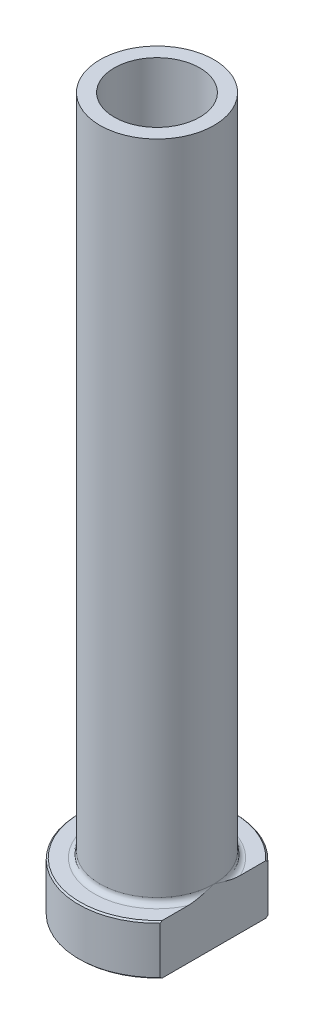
ISO-10303-21;
HEADER;
FILE_DESCRIPTION(('STEP AP214'),'2;1');
FILE_NAME('part.step','',(''),(''),'','','');
FILE_SCHEMA(('AUTOMOTIVE_DESIGN { 1 0 10303 214 1 1 1 1 }'));
ENDSEC;
DATA;
#1=APPLICATION_CONTEXT('core data for automotive mechanical design processes');
#2=APPLICATION_PROTOCOL_DEFINITION('international standard','automotive_design',2000,#1);
#3=PRODUCT_CONTEXT('',#1,'mechanical');
#4=PRODUCT('Part','Part','',(#3));
#5=PRODUCT_RELATED_PRODUCT_CATEGORY('part','',(#4));
#6=PRODUCT_DEFINITION_FORMATION('','',#4);
#7=PRODUCT_DEFINITION_CONTEXT('part definition',#1,'design');
#8=PRODUCT_DEFINITION('design','',#6,#7);
#9=PRODUCT_DEFINITION_SHAPE('','',#8);
#10=(LENGTH_UNIT() NAMED_UNIT(*) SI_UNIT(.MILLI.,.METRE.));
#11=(NAMED_UNIT(*) PLANE_ANGLE_UNIT() SI_UNIT($,.RADIAN.));
#12=(NAMED_UNIT(*) SI_UNIT($,.STERADIAN.) SOLID_ANGLE_UNIT());
#13=UNCERTAINTY_MEASURE_WITH_UNIT(LENGTH_MEASURE(1.E-05),#10,'distance_accuracy_value','');
#14=(GEOMETRIC_REPRESENTATION_CONTEXT(3) GLOBAL_UNCERTAINTY_ASSIGNED_CONTEXT((#13)) GLOBAL_UNIT_ASSIGNED_CONTEXT((#10,
#11,#12)) REPRESENTATION_CONTEXT('',''));
#15=CARTESIAN_POINT('',(0.,0.,0.));
#16=DIRECTION('',(0.,0.,1.));
#17=DIRECTION('',(1.,0.,0.));
#18=AXIS2_PLACEMENT_3D('',#15,#16,#17);
#19=CARTESIAN_POINT('',(0.,92.1876809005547,0.));
#20=DIRECTION('',(0.,1.,0.));
#21=DIRECTION('',(0.,0.,1.));
#22=AXIS2_PLACEMENT_3D('',#19,#20,#21);
#23=CYLINDRICAL_SURFACE('',#22,6.00000000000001);
#24=CARTESIAN_POINT('',(0.,100.,0.));
#25=DIRECTION('',(0.,1.,0.));
#26=DIRECTION('',(0.,0.,1.));
#27=AXIS2_PLACEMENT_3D('',#24,#25,#26);
#28=CIRCLE('',#27,6.00000000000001);
#29=CARTESIAN_POINT('',(0.,100.,6.00000000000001));
#30=VERTEX_POINT('',#29);
#31=EDGE_CURVE('E167',#30,#30,#28,.T.);
#32=ORIENTED_EDGE('',*,*,#31,.T.);
#33=EDGE_LOOP('',(#32));
#34=FACE_BOUND('',#33,.T.);
#35=CARTESIAN_POINT('',(0.,45.,0.));
#36=DIRECTION('',(0.,1.,0.));
#37=DIRECTION('',(0.,0.,1.));
#38=AXIS2_PLACEMENT_3D('',#35,#36,#37);
#39=CIRCLE('',#38,6.00000000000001);
#40=CARTESIAN_POINT('',(0.,45.,6.00000000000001));
#41=VERTEX_POINT('',#40);
#42=EDGE_CURVE('E170',#41,#41,#39,.T.);
#43=ORIENTED_EDGE('',*,*,#42,.F.);
#44=EDGE_LOOP('',(#43));
#45=FACE_BOUND('',#44,.T.);
#46=ADVANCED_FACE('F32',(#34,#45),#23,.F.);
#47=CARTESIAN_POINT('',(-6.00000000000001,100.,0.));
#48=DIRECTION('',(0.,1.,0.));
#49=DIRECTION('',(0.,0.,1.));
#50=AXIS2_PLACEMENT_3D('',#47,#48,#49);
#51=PLANE('',#50);
#52=CARTESIAN_POINT('',(0.,100.,0.));
#53=DIRECTION('',(0.,1.,0.));
#54=DIRECTION('',(0.,0.,1.));
#55=AXIS2_PLACEMENT_3D('',#52,#53,#54);
#56=CIRCLE('',#55,8.);
#57=CARTESIAN_POINT('',(0.,100.,8.));
#58=VERTEX_POINT('',#57);
#59=EDGE_CURVE('E174',#58,#58,#56,.T.);
#60=ORIENTED_EDGE('',*,*,#59,.T.);
#61=EDGE_LOOP('',(#60));
#62=FACE_BOUND('',#61,.T.);
#63=ORIENTED_EDGE('',*,*,#31,.F.);
#64=EDGE_LOOP('',(#63));
#65=FACE_BOUND('',#64,.T.);
#66=ADVANCED_FACE('F157',(#62,#65),#51,.T.);
#67=CARTESIAN_POINT('',(0.,92.1876809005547,0.));
#68=DIRECTION('',(0.,1.,0.));
#69=DIRECTION('',(0.,0.,1.));
#70=AXIS2_PLACEMENT_3D('',#67,#68,#69);
#71=CYLINDRICAL_SURFACE('',#70,7.99999999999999);
#72=CARTESIAN_POINT('',(0.,7.8,0.));
#73=DIRECTION('',(0.,1.,0.));
#74=DIRECTION('',(0.,0.,1.));
#75=AXIS2_PLACEMENT_3D('',#72,#73,#74);
#76=CIRCLE('',#75,7.99999999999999);
#77=CARTESIAN_POINT('',(8.,7.8,0.));
#78=VERTEX_POINT('',#77);
#79=EDGE_CURVE('E180',#78,#78,#76,.T.);
#80=ORIENTED_EDGE('',*,*,#79,.T.);
#81=EDGE_LOOP('',(#80));
#82=FACE_BOUND('',#81,.T.);
#83=ORIENTED_EDGE('',*,*,#59,.F.);
#84=EDGE_LOOP('',(#83));
#85=FACE_BOUND('',#84,.T.);
#86=ADVANCED_FACE('F162',(#82,#85),#71,.T.);
#87=CARTESIAN_POINT('',(-7.99999999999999,7.,0.));
#88=DIRECTION('',(0.,1.,0.));
#89=DIRECTION('',(0.,0.,1.));
#90=AXIS2_PLACEMENT_3D('',#87,#88,#89);
#91=PLANE('',#90);
#92=DIRECTION('',(0.,0.,1.));
#93=VECTOR('',#92,1.);
#94=CARTESIAN_POINT('',(8.,7.,0.));
#95=LINE('',#94,#93);
#96=CARTESIAN_POINT('',(8.,7.,-7.25534285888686));
#97=VERTEX_POINT('',#96);
#98=CARTESIAN_POINT('',(8.,7.,-3.66606055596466));
#99=VERTEX_POINT('',#98);
#100=EDGE_CURVE('E54',#97,#99,#95,.T.);
#101=ORIENTED_EDGE('',*,*,#100,.F.);
#102=CARTESIAN_POINT('',(0.,7.,0.));
#103=DIRECTION('',(0.,1.,0.));
#104=DIRECTION('',(0.,0.,1.));
#105=AXIS2_PLACEMENT_3D('',#102,#103,#104);
#106=CIRCLE('',#105,10.8);
#107=CARTESIAN_POINT('',(8.,7.,7.25534285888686));
#108=VERTEX_POINT('',#107);
#109=EDGE_CURVE('E186',#97,#108,#106,.T.);
#110=ORIENTED_EDGE('',*,*,#109,.T.);
#111=CARTESIAN_POINT('',(8.,7.,3.66606055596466));
#112=VERTEX_POINT('',#111);
#113=EDGE_CURVE('E134',#112,#108,#95,.T.);
#114=ORIENTED_EDGE('',*,*,#113,.F.);
#115=CARTESIAN_POINT('',(0.,7.,0.));
#116=DIRECTION('',(0.,1.,0.));
#117=DIRECTION('',(0.,0.,1.));
#118=AXIS2_PLACEMENT_3D('',#115,#116,#117);
#119=CIRCLE('',#118,8.8);
#120=EDGE_CURVE('E183',#112,#99,#119,.F.);
#121=ORIENTED_EDGE('',*,*,#120,.T.);
#122=EDGE_LOOP('',(#101,#110,#114,#121));
#123=FACE_BOUND('',#122,.T.);
#124=ADVANCED_FACE('F197',(#123),#91,.T.);
#125=CARTESIAN_POINT('',(0.,92.1876809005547,0.));
#126=DIRECTION('',(0.,1.,0.));
#127=DIRECTION('',(0.,0.,1.));
#128=AXIS2_PLACEMENT_3D('',#125,#126,#127);
#129=CYLINDRICAL_SURFACE('',#128,11.);
#130=DIRECTION('',(0.,-1.,0.));
#131=VECTOR('',#130,1.);
#132=CARTESIAN_POINT('',(8.,100.,7.54983443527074));
#133=LINE('',#132,#131);
#134=CARTESIAN_POINT('',(8.,6.80000000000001,7.54983443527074));
#135=VERTEX_POINT('',#134);
#136=CARTESIAN_POINT('',(8.,0.200000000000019,7.54983443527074));
#137=VERTEX_POINT('',#136);
#138=EDGE_CURVE('E82',#135,#137,#133,.T.);
#139=ORIENTED_EDGE('',*,*,#138,.F.);
#140=CARTESIAN_POINT('',(0.,6.80000000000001,0.));
#141=DIRECTION('',(0.,1.,0.));
#142=DIRECTION('',(0.,0.,1.));
#143=AXIS2_PLACEMENT_3D('',#140,#141,#142);
#144=CIRCLE('',#143,11.);
#145=CARTESIAN_POINT('',(8.,6.80000000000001,-7.54983443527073));
#146=VERTEX_POINT('',#145);
#147=EDGE_CURVE('E95',#135,#146,#144,.F.);
#148=ORIENTED_EDGE('',*,*,#147,.T.);
#149=DIRECTION('',(0.,-1.,0.));
#150=VECTOR('',#149,1.);
#151=CARTESIAN_POINT('',(8.,100.,-7.54983443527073));
#152=LINE('',#151,#150);
#153=CARTESIAN_POINT('',(8.,0.20000000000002,-7.54983443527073));
#154=VERTEX_POINT('',#153);
#155=EDGE_CURVE('E192',#146,#154,#152,.T.);
#156=ORIENTED_EDGE('',*,*,#155,.T.);
#157=CARTESIAN_POINT('',(0.,0.20000000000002,0.));
#158=DIRECTION('',(0.,-1.,0.));
#159=DIRECTION('',(0.,0.,-1.));
#160=AXIS2_PLACEMENT_3D('',#157,#158,#159);
#161=CIRCLE('',#160,11.);
#162=EDGE_CURVE('E98',#154,#137,#161,.F.);
#163=ORIENTED_EDGE('',*,*,#162,.T.);
#164=EDGE_LOOP('',(#139,#148,#156,#163));
#165=FACE_BOUND('',#164,.T.);
#166=ADVANCED_FACE('F190',(#165),#129,.T.);
#167=CARTESIAN_POINT('',(-11.,0.,0.));
#168=DIRECTION('',(0.,-1.,0.));
#169=DIRECTION('',(0.,0.,-1.));
#170=AXIS2_PLACEMENT_3D('',#167,#168,#169);
#171=PLANE('',#170);
#172=CARTESIAN_POINT('',(0.,0.,0.));
#173=DIRECTION('',(0.,-1.,0.));
#174=DIRECTION('',(0.,0.,-1.));
#175=AXIS2_PLACEMENT_3D('',#172,#173,#174);
#176=CIRCLE('',#175,6.75000000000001);
#177=CARTESIAN_POINT('',(0.,0.,-6.75000000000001));
#178=VERTEX_POINT('',#177);
#179=EDGE_CURVE('E40',#178,#178,#176,.F.);
#180=ORIENTED_EDGE('',*,*,#179,.T.);
#181=EDGE_LOOP('',(#180));
#182=FACE_BOUND('',#181,.T.);
#183=DIRECTION('',(0.,0.,-1.));
#184=VECTOR('',#183,1.);
#185=CARTESIAN_POINT('',(8.,0.,7.54983443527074));
#186=LINE('',#185,#184);
#187=CARTESIAN_POINT('',(8.,0.,7.25534285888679));
#188=VERTEX_POINT('',#187);
#189=CARTESIAN_POINT('',(8.,0.,-7.25534285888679));
#190=VERTEX_POINT('',#189);
#191=EDGE_CURVE('E47',#188,#190,#186,.T.);
#192=ORIENTED_EDGE('',*,*,#191,.F.);
#193=CARTESIAN_POINT('',(0.,0.,0.));
#194=DIRECTION('',(0.,-1.,0.));
#195=DIRECTION('',(0.,0.,-1.));
#196=AXIS2_PLACEMENT_3D('',#193,#194,#195);
#197=CIRCLE('',#196,10.8);
#198=EDGE_CURVE('E92',#188,#190,#197,.T.);
#199=ORIENTED_EDGE('',*,*,#198,.T.);
#200=EDGE_LOOP('',(#192,#199));
#201=FACE_BOUND('',#200,.T.);
#202=ADVANCED_FACE('F91',(#182,#201),#171,.T.);
#203=CARTESIAN_POINT('',(0.,92.1876809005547,0.));
#204=DIRECTION('',(0.,1.,0.));
#205=DIRECTION('',(0.,0.,1.));
#206=AXIS2_PLACEMENT_3D('',#203,#204,#205);
#207=CYLINDRICAL_SURFACE('',#206,6.24999999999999);
#208=CARTESIAN_POINT('',(0.,0.5,0.));
#209=DIRECTION('',(0.,-1.,0.));
#210=DIRECTION('',(0.,0.,-1.));
#211=AXIS2_PLACEMENT_3D('',#208,#209,#210);
#212=CIRCLE('',#211,6.24999999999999);
#213=CARTESIAN_POINT('',(0.,0.5,-6.24999999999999));
#214=VERTEX_POINT('',#213);
#215=EDGE_CURVE('E11',#214,#214,#212,.T.);
#216=ORIENTED_EDGE('',*,*,#215,.T.);
#217=EDGE_LOOP('',(#216));
#218=FACE_BOUND('',#217,.T.);
#219=CARTESIAN_POINT('',(0.,33.,0.));
#220=DIRECTION('',(0.,1.,0.));
#221=DIRECTION('',(0.,0.,1.));
#222=AXIS2_PLACEMENT_3D('',#219,#220,#221);
#223=CIRCLE('',#222,6.24999999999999);
#224=CARTESIAN_POINT('',(0.,33.,6.24999999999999));
#225=VERTEX_POINT('',#224);
#226=EDGE_CURVE('E172',#225,#225,#223,.T.);
#227=ORIENTED_EDGE('',*,*,#226,.T.);
#228=EDGE_LOOP('',(#227));
#229=FACE_BOUND('',#228,.T.);
#230=ADVANCED_FACE('F215',(#218,#229),#207,.F.);
#231=CARTESIAN_POINT('',(0.,33.,0.));
#232=DIRECTION('',(0.,-1.,0.));
#233=DIRECTION('',(0.,0.,-1.));
#234=AXIS2_PLACEMENT_3D('',#231,#232,#233);
#235=CONICAL_SURFACE('',#234,6.24999999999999,0.0208303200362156);
#236=ORIENTED_EDGE('',*,*,#42,.T.);
#237=EDGE_LOOP('',(#236));
#238=FACE_BOUND('',#237,.T.);
#239=ORIENTED_EDGE('',*,*,#226,.F.);
#240=EDGE_LOOP('',(#239));
#241=FACE_BOUND('',#240,.T.);
#242=ADVANCED_FACE('F111',(#238,#241),#235,.F.);
#243=CARTESIAN_POINT('',(0.,7.8,0.));
#244=DIRECTION('',(0.,1.,0.));
#245=DIRECTION('',(0.,0.,1.));
#246=AXIS2_PLACEMENT_3D('',#243,#244,#245);
#247=TOROIDAL_SURFACE('',#246,8.8,0.8);
#248=ORIENTED_EDGE('',*,*,#120,.F.);
#249=CARTESIAN_POINT('',(8.,7.8,0.));
#250=CARTESIAN_POINT('',(8.,7.8000010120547,-1.09624148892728E-10));
#251=CARTESIAN_POINT('',(8.,7.80000202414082,2.93324026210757E-07));
#252=CARTESIAN_POINT('',(8.,7.80000394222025,1.16283073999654E-06));
#253=CARTESIAN_POINT('',(8.,7.80000483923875,1.75365114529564E-06));
#254=CARTESIAN_POINT('',(8.,7.80000665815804,3.16446746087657E-06));
#255=CARTESIAN_POINT('',(8.,7.80000756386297,4.00549122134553E-06));
#256=CARTESIAN_POINT('',(8.,7.80000923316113,5.7834787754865E-06));
#257=CARTESIAN_POINT('',(8.,7.80000999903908,6.71841986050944E-06));
#258=CARTESIAN_POINT('',(8.,7.80001270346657,1.02037208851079E-05));
#259=CARTESIAN_POINT('',(8.,7.80001449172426,1.28740392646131E-05));
#260=CARTESIAN_POINT('',(8.,7.80001755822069,1.82727375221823E-05));
#261=CARTESIAN_POINT('',(8.,7.80001886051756,2.09881548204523E-05));
#262=CARTESIAN_POINT('',(8.,7.80002405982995,3.20647787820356E-05));
#263=CARTESIAN_POINT('',(8.,7.80002777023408,4.05225563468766E-05));
#264=CARTESIAN_POINT('',(8.,7.80003348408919,5.68037676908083E-05));
#265=CARTESIAN_POINT('',(8.,7.80003564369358,6.45728847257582E-05));
#266=CARTESIAN_POINT('',(8.,7.80005093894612,0.000121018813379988));
#267=CARTESIAN_POINT('',(8.,7.80006211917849,0.000170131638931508));
#268=CARTESIAN_POINT('',(8.,7.80011100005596,0.000362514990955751));
#269=CARTESIAN_POINT('',(8.,7.80015802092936,0.000503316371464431));
#270=CARTESIAN_POINT('',(8.,7.80033939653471,0.00105711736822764));
#271=CARTESIAN_POINT('',(8.,7.8004673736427,0.00147161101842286));
#272=CARTESIAN_POINT('',(8.,7.80097644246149,0.00310648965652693));
#273=CARTESIAN_POINT('',(8.,7.80136531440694,0.00432501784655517));
#274=CARTESIAN_POINT('',(7.99999999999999,7.80297358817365,0.0093795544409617));
#275=CARTESIAN_POINT('',(8.,7.80418342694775,0.0132178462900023));
#276=CARTESIAN_POINT('',(8.00000000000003,7.82754122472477,0.0873020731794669));
#277=CARTESIAN_POINT('',(8.00000000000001,7.84979021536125,0.157524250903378));
#278=CARTESIAN_POINT('',(7.99999999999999,7.89322681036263,0.295235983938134));
#279=CARTESIAN_POINT('',(8.,7.91442151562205,0.362723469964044));
#280=CARTESIAN_POINT('',(8.,7.95923432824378,0.506178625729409));
#281=CARTESIAN_POINT('',(8.,7.98282525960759,0.582154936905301));
#282=CARTESIAN_POINT('',(8.,8.02983069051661,0.735069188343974));
#283=CARTESIAN_POINT('',(8.,8.05324046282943,0.812008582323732));
#284=CARTESIAN_POINT('',(8.,8.09303795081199,0.944645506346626));
#285=CARTESIAN_POINT('',(8.,8.10956807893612,1.00030022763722));
#286=CARTESIAN_POINT('',(8.,8.1422128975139,1.11157683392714));
#287=CARTESIAN_POINT('',(8.,8.15832854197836,1.16719843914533));
#288=CARTESIAN_POINT('',(8.,8.20527739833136,1.33164052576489));
#289=CARTESIAN_POINT('',(8.,8.23549814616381,1.44063711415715));
#290=CARTESIAN_POINT('',(8.,8.29826335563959,1.67606835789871));
#291=CARTESIAN_POINT('',(8.,8.33044741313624,1.80259995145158));
#292=CARTESIAN_POINT('',(8.,8.39126396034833,2.05750030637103));
#293=CARTESIAN_POINT('',(8.,8.41986879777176,2.18587573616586));
#294=CARTESIAN_POINT('',(8.,8.4741420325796,2.45321874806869));
#295=CARTESIAN_POINT('',(8.,8.49943375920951,2.59226394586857));
#296=CARTESIAN_POINT('',(8.,8.54278750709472,2.8715056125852));
#297=CARTESIAN_POINT('',(8.,8.56085024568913,3.01170196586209));
#298=CARTESIAN_POINT('',(8.,8.58291287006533,3.24319459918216));
#299=CARTESIAN_POINT('',(8.,8.589627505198,3.33423069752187));
#300=CARTESIAN_POINT('',(8.,8.59844042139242,3.51651109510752));
#301=CARTESIAN_POINT('',(8.,8.60054027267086,3.60775531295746));
#302=CARTESIAN_POINT('',(8.,8.59923478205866,3.78855451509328));
#303=CARTESIAN_POINT('',(8.,8.59592927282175,3.87810991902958));
#304=CARTESIAN_POINT('',(8.,8.58288784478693,4.05671727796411));
#305=CARTESIAN_POINT('',(8.,8.57315718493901,4.14576958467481));
#306=CARTESIAN_POINT('',(8.,8.54786053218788,4.30910044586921));
#307=CARTESIAN_POINT('',(8.,8.53341905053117,4.38354919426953));
#308=CARTESIAN_POINT('',(8.,8.49747543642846,4.53120906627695));
#309=CARTESIAN_POINT('',(8.,8.47593618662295,4.60441150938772));
#310=CARTESIAN_POINT('',(8.,8.42376924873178,4.74853436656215));
#311=CARTESIAN_POINT('',(8.,8.39303920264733,4.81941853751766));
#312=CARTESIAN_POINT('',(8.,8.32008168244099,4.95490582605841));
#313=CARTESIAN_POINT('',(8.,8.27792970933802,5.01954653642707));
#314=CARTESIAN_POINT('',(8.,8.20692535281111,5.10354772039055));
#315=CARTESIAN_POINT('',(8.,8.18397837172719,5.12788591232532));
#316=CARTESIAN_POINT('',(8.,8.1350351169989,5.17336988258));
#317=CARTESIAN_POINT('',(8.,8.10903727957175,5.19451401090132));
#318=CARTESIAN_POINT('',(8.,8.05362521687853,5.23266411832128));
#319=CARTESIAN_POINT('',(8.,8.02417247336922,5.2496152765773));
#320=CARTESIAN_POINT('',(8.,7.96255238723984,5.27751973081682));
#321=CARTESIAN_POINT('',(8.,7.93039220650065,5.28848831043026));
#322=CARTESIAN_POINT('',(8.,7.87282733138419,5.30129051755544));
#323=CARTESIAN_POINT('',(8.,7.84777777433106,5.304735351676));
#324=CARTESIAN_POINT('',(8.,7.79745799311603,5.3073068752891));
#325=CARTESIAN_POINT('',(8.,7.77218785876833,5.30643524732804));
#326=CARTESIAN_POINT('',(8.,7.72220872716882,5.30045124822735));
#327=CARTESIAN_POINT('',(8.,7.69749884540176,5.2953461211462));
#328=CARTESIAN_POINT('',(8.,7.64919855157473,5.28130622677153));
#329=CARTESIAN_POINT('',(8.,7.62560888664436,5.27236894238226));
#330=CARTESIAN_POINT('',(8.,7.57186978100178,5.24749103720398));
#331=CARTESIAN_POINT('',(8.,7.54235117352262,5.23019143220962));
#332=CARTESIAN_POINT('',(8.,7.48647501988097,5.19107874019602));
#333=CARTESIAN_POINT('',(8.,7.46012476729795,5.16925554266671));
#334=CARTESIAN_POINT('',(8.,7.39758131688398,5.11005232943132));
#335=CARTESIAN_POINT('',(8.,7.36345256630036,5.07050732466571));
#336=CARTESIAN_POINT('',(8.,7.30158414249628,4.98680536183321));
#337=CARTESIAN_POINT('',(8.,7.27385227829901,4.94264286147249));
#338=CARTESIAN_POINT('',(8.,7.22655631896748,4.85651446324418));
#339=CARTESIAN_POINT('',(8.,7.20642608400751,4.81485346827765));
#340=CARTESIAN_POINT('',(8.,7.16979237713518,4.72995016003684));
#341=CARTESIAN_POINT('',(8.,7.15329194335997,4.68670655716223));
#342=CARTESIAN_POINT('',(8.,7.1082475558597,4.55471342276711));
#343=CARTESIAN_POINT('',(8.,7.08448205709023,4.46433285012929));
#344=CARTESIAN_POINT('',(8.,7.04606817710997,4.27884520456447));
#345=CARTESIAN_POINT('',(8.,7.03172934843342,4.18367881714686));
#346=CARTESIAN_POINT('',(8.,7.01115182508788,3.99231790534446));
#347=CARTESIAN_POINT('',(8.,7.00492963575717,3.8961216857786));
#348=CARTESIAN_POINT('',(8.,6.99917472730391,3.70683203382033));
#349=CARTESIAN_POINT('',(8.,6.99942213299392,3.6137441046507));
#350=CARTESIAN_POINT('',(8.,7.00500334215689,3.42814181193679));
#351=CARTESIAN_POINT('',(8.,7.01031504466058,3.33562671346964));
#352=CARTESIAN_POINT('',(8.,7.02729273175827,3.12465235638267));
#353=CARTESIAN_POINT('',(8.,7.04033732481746,3.00630616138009));
#354=CARTESIAN_POINT('',(8.,7.07206018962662,2.7704332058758));
#355=CARTESIAN_POINT('',(8.,7.09073668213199,2.65290619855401));
#356=CARTESIAN_POINT('',(8.,7.13314336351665,2.41598317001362));
#357=CARTESIAN_POINT('',(8.,7.15698005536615,2.29660645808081));
#358=CARTESIAN_POINT('',(8.,7.20856500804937,2.05839418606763));
#359=CARTESIAN_POINT('',(8.,7.23632304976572,1.93956077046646));
#360=CARTESIAN_POINT('',(8.,7.30538420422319,1.66026758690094));
#361=CARTESIAN_POINT('',(8.,7.3479797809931,1.50012949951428));
#362=CARTESIAN_POINT('',(8.,7.43661699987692,1.18271330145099));
#363=CARTESIAN_POINT('',(8.,7.48261587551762,1.02542306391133));
#364=CARTESIAN_POINT('',(8.,7.55073856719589,0.798945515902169));
#365=CARTESIAN_POINT('',(8.,7.57189590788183,0.729464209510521));
#366=CARTESIAN_POINT('',(8.,7.61466169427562,0.590318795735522));
#367=CARTESIAN_POINT('',(8.,7.63627166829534,0.520655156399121));
#368=CARTESIAN_POINT('',(8.,7.68075896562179,0.378072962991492));
#369=CARTESIAN_POINT('',(7.99999999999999,7.70364749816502,0.305157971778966));
#370=CARTESIAN_POINT('',(8.00000000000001,7.74926260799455,0.160522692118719));
#371=CARTESIAN_POINT('',(8.00000000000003,7.77198614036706,0.0888015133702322));
#372=CARTESIAN_POINT('',(8.,7.79581756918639,0.0132146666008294));
#373=CARTESIAN_POINT('',(7.99999999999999,7.79702841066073,0.00937319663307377));
#374=CARTESIAN_POINT('',(8.,7.79863692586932,0.00431792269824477));
#375=CARTESIAN_POINT('',(8.,7.79902501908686,0.00310183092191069));
#376=CARTESIAN_POINT('',(8.,7.79953313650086,0.00147000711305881));
#377=CARTESIAN_POINT('',(8.,7.79966092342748,0.00105612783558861));
#378=CARTESIAN_POINT('',(8.,7.79984206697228,0.000503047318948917));
#379=CARTESIAN_POINT('',(8.,7.79988905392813,0.000362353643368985));
#380=CARTESIAN_POINT('',(8.,7.79993790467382,0.000170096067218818));
#381=CARTESIAN_POINT('',(8.,7.7999490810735,0.000120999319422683));
#382=CARTESIAN_POINT('',(8.,7.79996436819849,6.45695774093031E-05));
#383=CARTESIAN_POINT('',(8.,7.79996652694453,5.68014442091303E-05));
#384=CARTESIAN_POINT('',(8.,7.7999722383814,4.05221672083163E-05));
#385=CARTESIAN_POINT('',(8.,7.79997594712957,3.20652901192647E-05));
#386=CARTESIAN_POINT('',(8.,7.79998114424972,2.09895688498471E-05));
#387=CARTESIAN_POINT('',(8.,7.79998244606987,1.82742250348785E-05));
#388=CARTESIAN_POINT('',(8.,7.79998551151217,1.28755875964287E-05));
#389=CARTESIAN_POINT('',(8.,7.79998729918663,1.02052490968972E-05));
#390=CARTESIAN_POINT('',(8.,7.79999000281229,6.71981807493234E-06));
#391=CARTESIAN_POINT('',(8.,7.79999076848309,5.78481736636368E-06));
#392=CARTESIAN_POINT('',(8.,7.7999924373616,4.00667324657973E-06));
#393=CARTESIAN_POINT('',(8.,7.79999334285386,3.16555171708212E-06));
#394=CARTESIAN_POINT('',(8.,7.79999516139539,1.75450195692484E-06));
#395=CARTESIAN_POINT('',(8.,7.79999605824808,1.163552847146E-06));
#396=CARTESIAN_POINT('',(8.,7.79999797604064,2.93728112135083E-07));
#397=CARTESIAN_POINT('',(8.,7.79999898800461,1.09621400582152E-10));
#398=CARTESIAN_POINT('',(8.,7.8,0.));
#399=B_SPLINE_CURVE_WITH_KNOTS('',3,(#249,#250,#251,#252,#253,#254,#255,#256,#257,#258,#259,
#260,#261,#262,#263,#264,#265,#266,#267,#268,#269,#270,#271,#272,#273,#274,#275,#276,#277,#278,
#279,#280,#281,#282,#283,#284,#285,#286,#287,#288,#289,#290,#291,#292,#293,#294,#295,#296,#297,
#298,#299,#300,#301,#302,#303,#304,#305,#306,#307,#308,#309,#310,#311,#312,#313,#314,#315,#316,
#317,#318,#319,#320,#321,#322,#323,#324,#325,#326,#327,#328,#329,#330,#331,#332,#333,#334,#335,
#336,#337,#338,#339,#340,#341,#342,#343,#344,#345,#346,#347,#348,#349,#350,#351,#352,#353,#354,
#355,#356,#357,#358,#359,#360,#361,#362,#363,#364,#365,#366,#367,#368,#369,#370,#371,#372,#373,
#374,#375,#376,#377,#378,#379,#380,#381,#382,#383,#384,#385,#386,#387,#388,#389,#390,#391,#392,
#393,#394,#395,#396,#397,#398),.UNSPECIFIED.,.T.,.F.,(4,2,2,2,2,2,2,2,2,2,2,2,2,2,2,2,2,2,2,2,2,
2,2,2,2,2,2,2,2,2,2,2,2,2,2,2,2,2,2,2,2,2,2,2,2,2,2,2,2,2,2,2,2,2,2,2,2,2,2,2,2,2,2,2,2,2,2,2,2,
2,2,2,2,2,4),(0.,3.04287706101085E-06,6.25420437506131E-06,9.9438686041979E-06,
1.35664386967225E-05,2.31665096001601E-05,3.21939900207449E-05,5.98353481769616E-05,
8.39944790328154E-05,0.000235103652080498,0.000679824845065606,0.00198183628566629,
0.00581831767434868,0.0178924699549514,0.238870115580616,0.451084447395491,0.689746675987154,
0.931010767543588,1.10518257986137,1.27890913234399,1.61821807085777,2.00985537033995,
2.40435266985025,2.82819297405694,3.25199120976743,3.52574836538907,3.79941235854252,
4.06807884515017,4.33652570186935,4.5637808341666,4.79224376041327,5.02335234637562,
5.25296903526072,5.35309534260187,5.45327319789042,5.55469877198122,5.65586400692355,
5.73137360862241,5.80685377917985,5.88220505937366,5.95760590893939,6.05967508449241,
6.16197489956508,6.31780492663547,6.47382418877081,6.61243130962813,6.7511540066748,
7.03070266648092,7.31902502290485,7.60793277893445,7.88703491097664,8.1649245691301,
8.52193605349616,8.87883486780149,9.24395493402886,9.61000233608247,10.1070420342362,
10.5986476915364,10.8165407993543,11.035354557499,11.264626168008,11.4903206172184,
11.5024047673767,11.5062335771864,11.5075336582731,11.5079780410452,11.5081291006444,
11.5081532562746,11.5081808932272,11.5081899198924,11.5081995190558,11.5082031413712,
11.5082068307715,11.5082100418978,11.5082130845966),.UNSPECIFIED.);
#400=EDGE_CURVE('E126',#112,#78,#399,.T.);
#401=ORIENTED_EDGE('',*,*,#400,.T.);
#402=ORIENTED_EDGE('',*,*,#79,.F.);
#403=CARTESIAN_POINT('',(8.,7.8,0.));
#404=CARTESIAN_POINT('',(8.,7.7999989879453,1.09627971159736E-10));
#405=CARTESIAN_POINT('',(8.,7.79999797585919,-2.93324022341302E-07));
#406=CARTESIAN_POINT('',(8.,7.79999605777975,-1.16283073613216E-06));
#407=CARTESIAN_POINT('',(8.,7.79999516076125,-1.75365114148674E-06));
#408=CARTESIAN_POINT('',(8.,7.79999334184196,-3.16446745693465E-06));
#409=CARTESIAN_POINT('',(8.,7.79999243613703,-4.00549121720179E-06));
#410=CARTESIAN_POINT('',(8.,7.79999076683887,-5.78347877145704E-06));
#411=CARTESIAN_POINT('',(8.,7.79999000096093,-6.71841985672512E-06));
#412=CARTESIAN_POINT('',(8.,7.79998729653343,-1.02037208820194E-05));
#413=CARTESIAN_POINT('',(8.,7.79998550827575,-1.28740392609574E-05));
#414=CARTESIAN_POINT('',(8.,7.79998244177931,-1.82727375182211E-05));
#415=CARTESIAN_POINT('',(8.,7.79998113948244,-2.09881548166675E-05));
#416=CARTESIAN_POINT('',(8.,7.79997594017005,-3.20647787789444E-05));
#417=CARTESIAN_POINT('',(8.,7.79997222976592,-4.05225563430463E-05));
#418=CARTESIAN_POINT('',(8.,7.79996651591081,-5.68037676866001E-05));
#419=CARTESIAN_POINT('',(8.,7.79996435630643,-6.4572884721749E-05));
#420=CARTESIAN_POINT('',(8.,7.79994906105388,-0.000121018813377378));
#421=CARTESIAN_POINT('',(8.,7.79993788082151,-0.000170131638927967));
#422=CARTESIAN_POINT('',(8.,7.79988899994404,-0.000362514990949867));
#423=CARTESIAN_POINT('',(8.,7.79984197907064,-0.000503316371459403));
#424=CARTESIAN_POINT('',(8.,7.79966060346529,-0.00105711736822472));
#425=CARTESIAN_POINT('',(8.,7.7995326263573,-0.00147161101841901));
#426=CARTESIAN_POINT('',(8.,7.7990235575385,-0.00310648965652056));
#427=CARTESIAN_POINT('',(8.,7.79863468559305,-0.00432501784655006));
#428=CARTESIAN_POINT('',(7.99999999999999,7.79702641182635,-0.00937955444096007));
#429=CARTESIAN_POINT('',(8.,7.79581657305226,-0.0132178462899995));
#430=CARTESIAN_POINT('',(8.00000000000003,7.77245877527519,-0.087302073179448));
#431=CARTESIAN_POINT('',(8.00000000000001,7.75020978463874,-0.157524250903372));
#432=CARTESIAN_POINT('',(7.99999999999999,7.70677318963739,-0.295235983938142));
#433=CARTESIAN_POINT('',(8.,7.68557848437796,-0.362723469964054));
#434=CARTESIAN_POINT('',(8.,7.64076567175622,-0.506178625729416));
#435=CARTESIAN_POINT('',(8.,7.61717474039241,-0.582154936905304));
#436=CARTESIAN_POINT('',(8.,7.57016930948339,-0.735069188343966));
#437=CARTESIAN_POINT('',(8.,7.54675953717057,-0.812008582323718));
#438=CARTESIAN_POINT('',(8.,7.50696204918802,-0.944645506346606));
#439=CARTESIAN_POINT('',(8.,7.49043192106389,-1.0003002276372));
#440=CARTESIAN_POINT('',(8.,7.4577871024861,-1.11157683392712));
#441=CARTESIAN_POINT('',(8.,7.44167145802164,-1.16719843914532));
#442=CARTESIAN_POINT('',(8.,7.39472260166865,-1.33164052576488));
#443=CARTESIAN_POINT('',(8.,7.3645018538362,-1.44063711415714));
#444=CARTESIAN_POINT('',(8.,7.30173664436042,-1.67606835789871));
#445=CARTESIAN_POINT('',(8.,7.26955258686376,-1.80259995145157));
#446=CARTESIAN_POINT('',(8.,7.20873603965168,-2.05750030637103));
#447=CARTESIAN_POINT('',(8.,7.18013120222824,-2.18587573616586));
#448=CARTESIAN_POINT('',(8.,7.1258579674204,-2.45321874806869));
#449=CARTESIAN_POINT('',(8.,7.10056624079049,-2.59226394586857));
#450=CARTESIAN_POINT('',(8.,7.05721249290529,-2.8715056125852));
#451=CARTESIAN_POINT('',(8.,7.03914975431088,-3.01170196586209));
#452=CARTESIAN_POINT('',(8.,7.01708712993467,-3.24319459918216));
#453=CARTESIAN_POINT('',(8.,7.010372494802,-3.33423069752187));
#454=CARTESIAN_POINT('',(8.,7.00155957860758,-3.51651109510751));
#455=CARTESIAN_POINT('',(8.,6.99945972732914,-3.60775531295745));
#456=CARTESIAN_POINT('',(8.,7.00076521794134,-3.78855451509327));
#457=CARTESIAN_POINT('',(8.,7.00407072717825,-3.87810991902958));
#458=CARTESIAN_POINT('',(8.,7.01711215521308,-4.05671727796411));
#459=CARTESIAN_POINT('',(8.,7.02684281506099,-4.14576958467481));
#460=CARTESIAN_POINT('',(8.,7.05213946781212,-4.30910044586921));
#461=CARTESIAN_POINT('',(8.,7.06658094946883,-4.38354919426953));
#462=CARTESIAN_POINT('',(8.,7.10252456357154,-4.53120906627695));
#463=CARTESIAN_POINT('',(8.,7.12406381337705,-4.60441150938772));
#464=CARTESIAN_POINT('',(8.,7.17623075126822,-4.74853436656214));
#465=CARTESIAN_POINT('',(8.,7.20696079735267,-4.81941853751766));
#466=CARTESIAN_POINT('',(8.,7.27991831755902,-4.95490582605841));
#467=CARTESIAN_POINT('',(8.,7.32207029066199,-5.01954653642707));
#468=CARTESIAN_POINT('',(8.,7.39307464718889,-5.10354772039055));
#469=CARTESIAN_POINT('',(8.,7.41602162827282,-5.12788591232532));
#470=CARTESIAN_POINT('',(8.,7.4649648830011,-5.17336988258));
#471=CARTESIAN_POINT('',(8.,7.49096272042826,-5.19451401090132));
#472=CARTESIAN_POINT('',(8.,7.54637478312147,-5.23266411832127));
#473=CARTESIAN_POINT('',(8.,7.57582752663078,-5.24961527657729));
#474=CARTESIAN_POINT('',(8.,7.63744761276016,-5.27751973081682));
#475=CARTESIAN_POINT('',(8.,7.66960779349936,-5.28848831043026));
#476=CARTESIAN_POINT('',(8.,7.72717266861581,-5.30129051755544));
#477=CARTESIAN_POINT('',(8.,7.75222222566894,-5.304735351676));
#478=CARTESIAN_POINT('',(8.,7.80254200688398,-5.3073068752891));
#479=CARTESIAN_POINT('',(8.,7.82781214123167,-5.30643524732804));
#480=CARTESIAN_POINT('',(8.,7.87779127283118,-5.30045124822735));
#481=CARTESIAN_POINT('',(8.,7.90250115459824,-5.2953461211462));
#482=CARTESIAN_POINT('',(8.,7.95080144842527,-5.28130622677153));
#483=CARTESIAN_POINT('',(8.,7.97439111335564,-5.27236894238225));
#484=CARTESIAN_POINT('',(8.,8.02813021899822,-5.24749103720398));
#485=CARTESIAN_POINT('',(8.,8.05764882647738,-5.23019143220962));
#486=CARTESIAN_POINT('',(8.,8.11352498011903,-5.19107874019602));
#487=CARTESIAN_POINT('',(8.,8.13987523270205,-5.16925554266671));
#488=CARTESIAN_POINT('',(8.,8.20241868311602,-5.11005232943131));
#489=CARTESIAN_POINT('',(8.,8.23654743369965,-5.0705073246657));
#490=CARTESIAN_POINT('',(8.,8.29841585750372,-4.9868053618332));
#491=CARTESIAN_POINT('',(8.,8.326147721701,-4.94264286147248));
#492=CARTESIAN_POINT('',(8.,8.37344368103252,-4.85651446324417));
#493=CARTESIAN_POINT('',(8.,8.39357391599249,-4.81485346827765));
#494=CARTESIAN_POINT('',(8.,8.43020762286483,-4.72995016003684));
#495=CARTESIAN_POINT('',(8.,8.44670805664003,-4.68670655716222));
#496=CARTESIAN_POINT('',(8.,8.4917524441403,-4.5547134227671));
#497=CARTESIAN_POINT('',(8.,8.51551794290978,-4.46433285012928));
#498=CARTESIAN_POINT('',(8.,8.55393182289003,-4.27884520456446));
#499=CARTESIAN_POINT('',(8.,8.56827065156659,-4.18367881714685));
#500=CARTESIAN_POINT('',(8.,8.58884817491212,-3.99231790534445));
#501=CARTESIAN_POINT('',(8.,8.59507036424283,-3.89612168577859));
#502=CARTESIAN_POINT('',(8.,8.60082527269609,-3.70683203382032));
#503=CARTESIAN_POINT('',(8.,8.60057786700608,-3.61374410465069));
#504=CARTESIAN_POINT('',(8.,8.59499665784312,-3.42814181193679));
#505=CARTESIAN_POINT('',(8.,8.58968495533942,-3.33562671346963));
#506=CARTESIAN_POINT('',(8.,8.57270726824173,-3.12465235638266));
#507=CARTESIAN_POINT('',(8.,8.55966267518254,-3.00630616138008));
#508=CARTESIAN_POINT('',(8.,8.52793981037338,-2.77043320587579));
#509=CARTESIAN_POINT('',(8.,8.50926331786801,-2.65290619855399));
#510=CARTESIAN_POINT('',(8.,8.46685663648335,-2.41598317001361));
#511=CARTESIAN_POINT('',(8.,8.44301994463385,-2.2966064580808));
#512=CARTESIAN_POINT('',(8.,8.39143499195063,-2.05839418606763));
#513=CARTESIAN_POINT('',(8.,8.36367695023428,-1.93956077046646));
#514=CARTESIAN_POINT('',(8.,8.29461579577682,-1.66026758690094));
#515=CARTESIAN_POINT('',(8.,8.2520202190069,-1.5001294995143));
#516=CARTESIAN_POINT('',(8.,8.16338300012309,-1.18271330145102));
#517=CARTESIAN_POINT('',(8.,8.1173841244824,-1.02542306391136));
#518=CARTESIAN_POINT('',(8.,8.04926143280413,-0.798945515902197));
#519=CARTESIAN_POINT('',(8.,8.02810409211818,-0.729464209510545));
#520=CARTESIAN_POINT('',(8.,7.98533830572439,-0.590318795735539));
#521=CARTESIAN_POINT('',(8.,7.96372833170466,-0.520655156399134));
#522=CARTESIAN_POINT('',(8.,7.91924103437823,-0.378072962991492));
#523=CARTESIAN_POINT('',(7.99999999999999,7.89635250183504,-0.305157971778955));
#524=CARTESIAN_POINT('',(8.00000000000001,7.8507373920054,-0.160522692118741));
#525=CARTESIAN_POINT('',(8.00000000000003,7.82801385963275,-0.0888015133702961));
#526=CARTESIAN_POINT('',(8.,7.80418243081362,-0.0132146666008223));
#527=CARTESIAN_POINT('',(7.99999999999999,7.8029715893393,-0.00937319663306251));
#528=CARTESIAN_POINT('',(8.,7.80136307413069,-0.0043179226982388));
#529=CARTESIAN_POINT('',(8.,7.80097498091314,-0.00310183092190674));
#530=CARTESIAN_POINT('',(8.,7.80046686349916,-0.00147000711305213));
#531=CARTESIAN_POINT('',(8.,7.80033907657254,-0.00105612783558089));
#532=CARTESIAN_POINT('',(8.,7.80015793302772,-0.000503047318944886));
#533=CARTESIAN_POINT('',(8.,7.80011094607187,-0.000362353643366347));
#534=CARTESIAN_POINT('',(8.,7.80006209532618,-0.000170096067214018));
#535=CARTESIAN_POINT('',(8.,7.80005091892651,-0.000120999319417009));
#536=CARTESIAN_POINT('',(8.,7.80003563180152,-6.45695774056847E-05));
#537=CARTESIAN_POINT('',(8.,7.80003347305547,-5.68014442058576E-05));
#538=CARTESIAN_POINT('',(8.,7.8000277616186,-4.05221672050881E-05));
#539=CARTESIAN_POINT('',(8.,7.80002405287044,-3.20652901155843E-05));
#540=CARTESIAN_POINT('',(8.,7.80001885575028,-2.0989568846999E-05));
#541=CARTESIAN_POINT('',(8.,7.80001755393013,-1.8274225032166E-05));
#542=CARTESIAN_POINT('',(8.,7.80001448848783,-1.28755875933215E-05));
#543=CARTESIAN_POINT('',(8.,7.80001270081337,-1.02052490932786E-05));
#544=CARTESIAN_POINT('',(8.,7.80000999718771,-6.71981807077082E-06));
#545=CARTESIAN_POINT('',(8.,7.80000923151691,-5.78481736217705E-06));
#546=CARTESIAN_POINT('',(8.,7.8000075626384,-4.00667324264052E-06));
#547=CARTESIAN_POINT('',(8.,7.80000665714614,-3.1655517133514E-06));
#548=CARTESIAN_POINT('',(8.,7.80000483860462,-1.75450195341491E-06));
#549=CARTESIAN_POINT('',(8.,7.80000394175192,-1.16355284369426E-06));
#550=CARTESIAN_POINT('',(8.,7.80000202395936,-2.93728108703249E-07));
#551=CARTESIAN_POINT('',(8.,7.80000101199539,-1.09617870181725E-10));
#552=CARTESIAN_POINT('',(8.,7.8,0.));
#553=B_SPLINE_CURVE_WITH_KNOTS('',3,(#403,#404,#405,#406,#407,#408,#409,#410,#411,#412,#413,
#414,#415,#416,#417,#418,#419,#420,#421,#422,#423,#424,#425,#426,#427,#428,#429,#430,#431,#432,
#433,#434,#435,#436,#437,#438,#439,#440,#441,#442,#443,#444,#445,#446,#447,#448,#449,#450,#451,
#452,#453,#454,#455,#456,#457,#458,#459,#460,#461,#462,#463,#464,#465,#466,#467,#468,#469,#470,
#471,#472,#473,#474,#475,#476,#477,#478,#479,#480,#481,#482,#483,#484,#485,#486,#487,#488,#489,
#490,#491,#492,#493,#494,#495,#496,#497,#498,#499,#500,#501,#502,#503,#504,#505,#506,#507,#508,
#509,#510,#511,#512,#513,#514,#515,#516,#517,#518,#519,#520,#521,#522,#523,#524,#525,#526,#527,
#528,#529,#530,#531,#532,#533,#534,#535,#536,#537,#538,#539,#540,#541,#542,#543,#544,#545,#546,
#547,#548,#549,#550,#551,#552),.UNSPECIFIED.,.T.,.F.,(4,2,2,2,2,2,2,2,2,2,2,2,2,2,2,2,2,2,2,2,2,
2,2,2,2,2,2,2,2,2,2,2,2,2,2,2,2,2,2,2,2,2,2,2,2,2,2,2,2,2,2,2,2,2,2,2,2,2,2,2,2,2,2,2,2,2,2,2,2,
2,2,2,2,2,4),(0.,3.04287706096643E-06,6.25420437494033E-06,9.94386860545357E-06,
1.35664386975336E-05,2.31665096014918E-05,3.2193990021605E-05,5.98353481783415E-05,
8.3994479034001E-05,0.000235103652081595,0.000679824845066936,0.00198183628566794,
0.00581831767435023,0.0178924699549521,0.238870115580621,0.451084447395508,0.689746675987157,
0.931010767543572,1.10518257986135,1.27890913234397,1.61821807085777,2.00985537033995,
2.40435266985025,2.82819297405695,3.25199120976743,3.52574836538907,3.79941235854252,
4.06807884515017,4.33652570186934,4.5637808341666,4.79224376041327,5.02335234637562,
5.25296903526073,5.35309534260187,5.45327319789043,5.55469877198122,5.65586400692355,
5.73137360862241,5.80685377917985,5.88220505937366,5.95760590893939,6.05967508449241,
6.16197489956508,6.31780492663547,6.47382418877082,6.61243130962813,6.7511540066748,
7.03070266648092,7.31902502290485,7.60793277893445,7.88703491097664,8.1649245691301,
8.52193605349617,8.8788348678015,9.24395493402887,9.61000233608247,10.1070420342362,
10.5986476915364,10.8165407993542,11.0353545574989,11.264626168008,11.4903206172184,
11.5024047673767,11.5062335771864,11.5075336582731,11.5079780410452,11.5081291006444,
11.5081532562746,11.5081808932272,11.5081899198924,11.5081995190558,11.5082031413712,
11.5082068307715,11.5082100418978,11.5082130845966),.UNSPECIFIED.);
#554=EDGE_CURVE('E135',#78,#99,#553,.T.);
#555=ORIENTED_EDGE('',*,*,#554,.T.);
#556=EDGE_LOOP('',(#248,#401,#402,#555));
#557=FACE_BOUND('',#556,.T.);
#558=ADVANCED_FACE('F141',(#557),#247,.F.);
#559=CARTESIAN_POINT('',(0.,7.00000000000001,0.));
#560=DIRECTION('',(0.,-1.,0.));
#561=DIRECTION('',(0.,0.,-1.));
#562=AXIS2_PLACEMENT_3D('',#559,#560,#561);
#563=CONICAL_SURFACE('',#562,10.8,0.785398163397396);
#564=CARTESIAN_POINT('',(8.,-0.636730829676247,-16.6106304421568));
#565=CARTESIAN_POINT('',(8.,-0.418611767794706,-16.3685283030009));
#566=CARTESIAN_POINT('',(8.,-0.200984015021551,-16.1259843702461));
#567=CARTESIAN_POINT('',(8.,0.233148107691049,-15.6398927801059));
#568=CARTESIAN_POINT('',(8.,0.449652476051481,-15.3963451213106));
#569=CARTESIAN_POINT('',(8.,1.09739989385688,-14.6638687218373));
#570=CARTESIAN_POINT('',(8.,1.52674426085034,-14.1732538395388));
#571=CARTESIAN_POINT('',(8.,2.16792810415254,-13.4304656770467));
#572=CARTESIAN_POINT('',(8.,2.38226067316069,-13.1804430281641));
#573=CARTESIAN_POINT('',(8.,2.80892954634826,-12.6787083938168));
#574=CARTESIAN_POINT('',(8.,3.02126589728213,-12.4269964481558));
#575=CARTESIAN_POINT('',(8.,3.44357020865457,-11.9216744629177));
#576=CARTESIAN_POINT('',(8.,3.65353861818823,-11.6680647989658));
#577=CARTESIAN_POINT('',(8.,4.07074862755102,-11.1585723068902));
#578=CARTESIAN_POINT('',(8.,4.27798998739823,-10.9026892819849));
#579=CARTESIAN_POINT('',(8.,4.66965190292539,-10.4127607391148));
#580=CARTESIAN_POINT('',(8.,4.85436868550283,-10.1789522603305));
#581=CARTESIAN_POINT('',(8.,5.22063517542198,-9.70886883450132));
#582=CARTESIAN_POINT('',(8.,5.40218492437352,-9.4725939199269));
#583=CARTESIAN_POINT('',(8.,5.76149237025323,-8.99721569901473));
#584=CARTESIAN_POINT('',(8.,5.93925050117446,-8.75811272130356));
#585=CARTESIAN_POINT('',(8.,6.29022306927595,-8.27660199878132));
#586=CARTESIAN_POINT('',(8.,6.46343768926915,-8.03419438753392));
#587=CARTESIAN_POINT('',(8.,6.80398487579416,-7.54604999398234));
#588=CARTESIAN_POINT('',(8.,6.97132935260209,-7.30032154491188));
#589=CARTESIAN_POINT('',(8.,7.29928849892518,-6.80437777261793));
#590=CARTESIAN_POINT('',(8.,7.45990280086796,-6.55416220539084));
#591=CARTESIAN_POINT('',(8.,7.77264940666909,-6.04873149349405));
#592=CARTESIAN_POINT('',(8.,7.92478824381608,-5.79352041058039));
#593=CARTESIAN_POINT('',(8.,8.21859570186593,-5.27715744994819));
#594=CARTESIAN_POINT('',(8.,8.36026610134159,-5.01600659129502));
#595=CARTESIAN_POINT('',(8.,8.62213596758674,-4.50319242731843));
#596=CARTESIAN_POINT('',(8.,8.74311989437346,-4.25193242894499));
#597=CARTESIAN_POINT('',(8.,8.97065709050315,-3.74287674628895));
#598=CARTESIAN_POINT('',(8.,9.07720941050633,-3.48508063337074));
#599=CARTESIAN_POINT('',(8.,9.27220860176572,-2.96337495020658));
#600=CARTESIAN_POINT('',(8.,9.36069936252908,-2.69948197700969));
#601=CARTESIAN_POINT('',(8.,9.51604316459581,-2.16542713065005));
#602=CARTESIAN_POINT('',(8.,9.58290677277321,-1.89526838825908));
#603=CARTESIAN_POINT('',(8.,9.68291221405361,-1.39216000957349));
#604=CARTESIAN_POINT('',(8.,9.71967474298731,-1.15993430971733));
#605=CARTESIAN_POINT('',(8.,9.77336730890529,-0.6931966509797));
#606=CARTESIAN_POINT('',(8.,9.7903003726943,-0.458685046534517));
#607=CARTESIAN_POINT('',(8.,9.80342851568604,0.0106727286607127));
#608=CARTESIAN_POINT('',(8.,9.79964609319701,0.245518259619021));
#609=CARTESIAN_POINT('',(8.,9.77160926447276,0.71398933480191));
#610=CARTESIAN_POINT('',(8.,9.74735189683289,0.947614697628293));
#611=CARTESIAN_POINT('',(8.,9.67070830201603,1.47287443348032));
#612=CARTESIAN_POINT('',(8.,9.61261890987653,1.76367634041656));
#613=CARTESIAN_POINT('',(8.,9.46982192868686,2.33873282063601));
#614=CARTESIAN_POINT('',(8.,9.38509750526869,2.62298313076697));
#615=CARTESIAN_POINT('',(8.,9.24134311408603,3.04436856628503));
#616=CARTESIAN_POINT('',(8.,9.19048552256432,3.18437323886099));
#617=CARTESIAN_POINT('',(8.,9.08381674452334,3.46241560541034));
#618=CARTESIAN_POINT('',(8.,9.02800782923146,3.60045416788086));
#619=CARTESIAN_POINT('',(8.,8.91195481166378,3.87463242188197));
#620=CARTESIAN_POINT('',(8.,8.85171106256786,4.0107722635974));
#621=CARTESIAN_POINT('',(8.,8.72725899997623,4.28124317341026));
#622=CARTESIAN_POINT('',(8.,8.6630501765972,4.41557400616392));
#623=CARTESIAN_POINT('',(8.,8.48984738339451,4.76597692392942));
#624=CARTESIAN_POINT('',(8.,8.37796178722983,4.98062176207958));
#625=CARTESIAN_POINT('',(8.,8.14649205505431,5.40573762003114));
#626=CARTESIAN_POINT('',(8.,8.02690659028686,5.61620791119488));
#627=CARTESIAN_POINT('',(8.,7.78128707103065,6.03349586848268));
#628=CARTESIAN_POINT('',(8.,7.65524949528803,6.2403114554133));
#629=CARTESIAN_POINT('',(8.,7.39783636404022,6.65060320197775));
#630=CARTESIAN_POINT('',(8.,7.26646042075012,6.8540791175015));
#631=CARTESIAN_POINT('',(8.,6.99890352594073,7.25856399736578));
#632=CARTESIAN_POINT('',(8.,6.86271149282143,7.45956561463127));
#633=CARTESIAN_POINT('',(8.,6.58651908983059,7.85893907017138));
#634=CARTESIAN_POINT('',(8.,6.44651858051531,8.057310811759));
#635=CARTESIAN_POINT('',(8.,6.0217824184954,8.64881247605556));
#636=CARTESIAN_POINT('',(8.,5.73221467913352,9.03847436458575));
#637=CARTESIAN_POINT('',(8.,5.14234581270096,9.81218500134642));
#638=CARTESIAN_POINT('',(8.,4.84200393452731,10.1962024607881));
#639=CARTESIAN_POINT('',(8.,4.2340481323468,10.9584616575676));
#640=CARTESIAN_POINT('',(7.99999999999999,3.92643376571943,11.3367030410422));
#641=CARTESIAN_POINT('',(7.99999999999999,3.30600745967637,12.0880358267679));
#642=CARTESIAN_POINT('',(7.99999999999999,2.9932030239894,12.4611334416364));
#643=CARTESIAN_POINT('',(7.99999999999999,2.363178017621,13.2035599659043));
#644=CARTESIAN_POINT('',(7.99999999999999,2.0459575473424,13.5728889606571));
#645=CARTESIAN_POINT('',(7.99999999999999,1.33644011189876,14.3909378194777));
#646=CARTESIAN_POINT('',(7.99999999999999,0.943258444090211,14.8388897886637));
#647=CARTESIAN_POINT('',(7.99999999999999,0.351483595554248,15.5068127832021));
#648=CARTESIAN_POINT('',(7.99999999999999,0.154449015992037,15.7281687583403));
#649=CARTESIAN_POINT('',(7.99999999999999,-0.24049862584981,16.1700151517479));
#650=CARTESIAN_POINT('',(7.99999999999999,-0.438411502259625,16.3905057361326));
#651=CARTESIAN_POINT('',(7.99999999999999,-0.636730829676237,16.6106304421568));
#652=B_SPLINE_CURVE_WITH_KNOTS('',3,(#564,#565,#566,#567,#568,#569,#570,#571,#572,#573,#574,
#575,#576,#577,#578,#579,#580,#581,#582,#583,#584,#585,#586,#587,#588,#589,#590,#591,#592,#593,
#594,#595,#596,#597,#598,#599,#600,#601,#602,#603,#604,#605,#606,#607,#608,#609,#610,#611,#612,
#613,#614,#615,#616,#617,#618,#619,#620,#621,#622,#623,#624,#625,#626,#627,#628,#629,#630,#631,
#632,#633,#634,#635,#636,#637,#638,#639,#640,#641,#642,#643,#644,#645,#646,#647,#648,#649,#650,
#651),.UNSPECIFIED.,.F.,.F.,(4,2,2,2,2,2,2,2,2,2,2,2,2,2,2,2,2,2,2,2,2,2,2,2,2,2,2,2,2,2,2,2,2,
2,2,2,2,2,2,2,2,2,2,4),(0.,0.977598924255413,1.95519922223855,3.91099512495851,4.89893858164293,
5.88685884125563,6.87458847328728,7.86240445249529,8.75629469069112,9.65017317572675,
10.5439487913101,11.4376883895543,12.3294952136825,13.2213506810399,14.1125088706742,
15.0035153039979,15.8397621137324,16.6760639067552,17.5103086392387,18.3441451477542,
19.048722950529,19.7531931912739,20.4568984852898,21.1607055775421,22.0488428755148,
22.9375426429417,23.3843335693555,23.830920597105,24.2774720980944,24.7240811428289,
25.4500411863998,26.1761268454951,26.90261308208,27.6291521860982,28.3574884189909,
29.0858513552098,30.5420520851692,32.0045059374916,33.467049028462,34.9276355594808,
36.3881889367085,38.1762452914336,39.0652821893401,39.9541391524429),.UNSPECIFIED.);
#653=EDGE_CURVE('E133',#146,#97,#652,.T.);
#654=ORIENTED_EDGE('',*,*,#653,.F.);
#655=ORIENTED_EDGE('',*,*,#147,.F.);
#656=EDGE_CURVE('E118',#108,#135,#652,.T.);
#657=ORIENTED_EDGE('',*,*,#656,.F.);
#658=ORIENTED_EDGE('',*,*,#109,.F.);
#659=EDGE_LOOP('',(#654,#655,#657,#658));
#660=FACE_BOUND('',#659,.T.);
#661=ADVANCED_FACE('F145',(#660),#563,.T.);
#662=CARTESIAN_POINT('',(0.,0.20000000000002,0.));
#663=DIRECTION('',(0.,1.,0.));
#664=DIRECTION('',(0.,0.,1.));
#665=AXIS2_PLACEMENT_3D('',#662,#663,#664);
#666=CONICAL_SURFACE('',#665,11.,0.785398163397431);
#667=CARTESIAN_POINT('',(7.99999999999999,7.63673082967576,16.6106304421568));
#668=CARTESIAN_POINT('',(7.99999999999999,7.41861176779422,16.3685283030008));
#669=CARTESIAN_POINT('',(7.99999999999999,7.20098401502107,16.1259843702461));
#670=CARTESIAN_POINT('',(7.99999999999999,6.76685189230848,15.6398927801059));
#671=CARTESIAN_POINT('',(7.99999999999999,6.55034752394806,15.3963451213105));
#672=CARTESIAN_POINT('',(7.99999999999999,5.90260010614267,14.6638687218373));
#673=CARTESIAN_POINT('',(7.99999999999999,5.47325573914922,14.1732538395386));
#674=CARTESIAN_POINT('',(7.99999999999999,4.83207189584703,13.4304656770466));
#675=CARTESIAN_POINT('',(7.99999999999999,4.61773932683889,13.1804430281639));
#676=CARTESIAN_POINT('',(7.99999999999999,4.19107045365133,12.6787083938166));
#677=CARTESIAN_POINT('',(7.99999999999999,3.97873410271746,12.4269964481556));
#678=CARTESIAN_POINT('',(7.99999999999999,3.55642979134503,11.9216744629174));
#679=CARTESIAN_POINT('',(7.99999999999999,3.34646138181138,11.6680647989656));
#680=CARTESIAN_POINT('',(7.99999999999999,2.92925137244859,11.1585723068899));
#681=CARTESIAN_POINT('',(8.,2.72201001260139,10.9026892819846));
#682=CARTESIAN_POINT('',(8.,2.33034809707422,10.4127607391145));
#683=CARTESIAN_POINT('',(8.,2.14563131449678,10.1789522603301));
#684=CARTESIAN_POINT('',(8.,1.7793648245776,9.70886883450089));
#685=CARTESIAN_POINT('',(8.,1.59781507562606,9.47259391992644));
#686=CARTESIAN_POINT('',(8.,1.23850762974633,8.99721569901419));
#687=CARTESIAN_POINT('',(8.,1.06074949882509,8.75811272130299));
#688=CARTESIAN_POINT('',(8.,0.709776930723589,8.27660199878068));
#689=CARTESIAN_POINT('',(8.,0.536562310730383,8.03419438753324));
#690=CARTESIAN_POINT('',(8.,0.196015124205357,7.5460499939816));
#691=CARTESIAN_POINT('',(8.,0.0286706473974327,7.3003215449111));
#692=CARTESIAN_POINT('',(8.,-0.299288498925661,6.80437777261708));
#693=CARTESIAN_POINT('',(8.,-0.459902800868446,6.55416220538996));
#694=CARTESIAN_POINT('',(8.,-0.772649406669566,6.04873149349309));
#695=CARTESIAN_POINT('',(8.,-0.924788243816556,5.79352041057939));
#696=CARTESIAN_POINT('',(8.,-1.2185957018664,5.27715744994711));
#697=CARTESIAN_POINT('',(8.,-1.36026610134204,5.0160065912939));
#698=CARTESIAN_POINT('',(8.,-1.62213596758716,4.50319242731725));
#699=CARTESIAN_POINT('',(8.,-1.74311989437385,4.2519324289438));
#700=CARTESIAN_POINT('',(8.,-1.97065709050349,3.74287674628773));
#701=CARTESIAN_POINT('',(8.,-2.07720941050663,3.48508063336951));
#702=CARTESIAN_POINT('',(8.,-2.27220860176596,2.96337495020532));
#703=CARTESIAN_POINT('',(8.,-2.36069936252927,2.69948197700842));
#704=CARTESIAN_POINT('',(8.,-2.51604316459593,2.16542713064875));
#705=CARTESIAN_POINT('',(8.,-2.58290677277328,1.89526838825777));
#706=CARTESIAN_POINT('',(8.,-2.6829122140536,1.39216000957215));
#707=CARTESIAN_POINT('',(8.,-2.71967474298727,1.15993430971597));
#708=CARTESIAN_POINT('',(8.,-2.77336730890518,0.693196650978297));
#709=CARTESIAN_POINT('',(8.,-2.79030037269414,0.458685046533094));
#710=CARTESIAN_POINT('',(8.,-2.8034285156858,-0.0106727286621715));
#711=CARTESIAN_POINT('',(8.,-2.79964609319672,-0.245518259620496));
#712=CARTESIAN_POINT('',(8.,-2.77160926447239,-0.713989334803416));
#713=CARTESIAN_POINT('',(8.,-2.74735189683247,-0.947614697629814));
#714=CARTESIAN_POINT('',(8.,-2.6707083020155,-1.47287443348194));
#715=CARTESIAN_POINT('',(8.,-2.61261890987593,-1.76367634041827));
#716=CARTESIAN_POINT('',(8.,-2.46982192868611,-2.3387328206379));
#717=CARTESIAN_POINT('',(8.,-2.38509750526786,-2.62298313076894));
#718=CARTESIAN_POINT('',(8.,-2.24134311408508,-3.04436856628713));
#719=CARTESIAN_POINT('',(8.,-2.19048552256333,-3.18437323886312));
#720=CARTESIAN_POINT('',(8.,-2.08381674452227,-3.46241560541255));
#721=CARTESIAN_POINT('',(8.,-2.02800782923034,-3.60045416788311));
#722=CARTESIAN_POINT('',(8.,-1.91195481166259,-3.87463242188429));
#723=CARTESIAN_POINT('',(8.,-1.85171106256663,-4.01077226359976));
#724=CARTESIAN_POINT('',(8.,-1.72725899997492,-4.28124317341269));
#725=CARTESIAN_POINT('',(8.,-1.66305017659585,-4.41557400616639));
#726=CARTESIAN_POINT('',(8.,-1.48984738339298,-4.76597692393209));
#727=CARTESIAN_POINT('',(8.,-1.37796178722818,-4.98062176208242));
#728=CARTESIAN_POINT('',(8.,-1.1464920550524,-5.40573762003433));
#729=CARTESIAN_POINT('',(8.,-1.02690659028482,-5.61620791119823));
#730=CARTESIAN_POINT('',(8.,-0.781287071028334,-6.03349586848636));
#731=CARTESIAN_POINT('',(8.,-0.655249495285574,-6.24031145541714));
#732=CARTESIAN_POINT('',(8.,-0.397836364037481,-6.65060320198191));
#733=CARTESIAN_POINT('',(8.,-0.266460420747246,-6.85407911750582));
#734=CARTESIAN_POINT('',(8.,0.0010964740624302,-7.25856399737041));
#735=CARTESIAN_POINT('',(8.,0.137288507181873,-7.45956561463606));
#736=CARTESIAN_POINT('',(8.,0.413480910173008,-7.85893907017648));
#737=CARTESIAN_POINT('',(8.,0.55348141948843,-8.05731081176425));
#738=CARTESIAN_POINT('',(8.,0.978217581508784,-8.64881247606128));
#739=CARTESIAN_POINT('',(8.,1.26778532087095,-9.03847436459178));
#740=CARTESIAN_POINT('',(8.,1.8576541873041,-9.81218500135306));
#741=CARTESIAN_POINT('',(8.,2.15799606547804,-10.196202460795));
#742=CARTESIAN_POINT('',(8.,2.76595186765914,-10.9584616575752));
#743=CARTESIAN_POINT('',(8.,3.0735662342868,-11.33670304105));
#744=CARTESIAN_POINT('',(8.,3.69399254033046,-12.0880358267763));
#745=CARTESIAN_POINT('',(8.,4.00679697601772,-12.4611334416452));
#746=CARTESIAN_POINT('',(8.,4.6368219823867,-13.2035599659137));
#747=CARTESIAN_POINT('',(8.,4.9540424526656,-13.5728889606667));
#748=CARTESIAN_POINT('',(8.,5.6635598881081,-14.3909378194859));
#749=CARTESIAN_POINT('',(8.,6.05674155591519,-14.8388897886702));
#750=CARTESIAN_POINT('',(8.,6.64851640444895,-15.5068127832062));
#751=CARTESIAN_POINT('',(8.,6.84555098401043,-15.7281687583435));
#752=CARTESIAN_POINT('',(8.,7.24049862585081,-16.1700151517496));
#753=CARTESIAN_POINT('',(8.,7.43841150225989,-16.3905057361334));
#754=CARTESIAN_POINT('',(8.,7.63673082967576,-16.6106304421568));
#755=B_SPLINE_CURVE_WITH_KNOTS('',3,(#667,#668,#669,#670,#671,#672,#673,#674,#675,#676,#677,
#678,#679,#680,#681,#682,#683,#684,#685,#686,#687,#688,#689,#690,#691,#692,#693,#694,#695,#696,
#697,#698,#699,#700,#701,#702,#703,#704,#705,#706,#707,#708,#709,#710,#711,#712,#713,#714,#715,
#716,#717,#718,#719,#720,#721,#722,#723,#724,#725,#726,#727,#728,#729,#730,#731,#732,#733,#734,
#735,#736,#737,#738,#739,#740,#741,#742,#743,#744,#745,#746,#747,#748,#749,#750,#751,#752,#753,
#754),.UNSPECIFIED.,.F.,.F.,(4,2,2,2,2,2,2,2,2,2,2,2,2,2,2,2,2,2,2,2,2,2,2,2,2,2,2,2,2,2,2,2,2,
2,2,2,2,2,2,2,2,2,2,4),(0.,0.977598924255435,1.95519922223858,3.91099512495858,4.89893858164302,
5.88685884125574,6.87458847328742,7.86240445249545,8.75629469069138,9.6501731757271,
10.5439487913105,11.4376883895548,12.3294952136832,13.2213506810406,14.112508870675,
15.0035153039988,15.8397621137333,16.6760639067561,17.5103086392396,18.3441451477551,
19.04872295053,19.7531931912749,20.4568984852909,21.1607055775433,22.0488428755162,
22.9375426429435,23.3843335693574,23.8309205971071,24.2774720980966,24.7240811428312,
25.4500411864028,26.1761268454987,26.9026130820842,27.6291521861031,28.3574884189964,
29.0858513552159,30.5420520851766,32.0045059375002,33.4670490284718,34.927635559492,
36.3881889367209,38.1762452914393,39.0652821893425,39.9541391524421),.UNSPECIFIED.);
#756=EDGE_CURVE('E79',#137,#188,#755,.T.);
#757=ORIENTED_EDGE('',*,*,#756,.F.);
#758=ORIENTED_EDGE('',*,*,#162,.F.);
#759=EDGE_CURVE('E87',#190,#154,#755,.T.);
#760=ORIENTED_EDGE('',*,*,#759,.F.);
#761=ORIENTED_EDGE('',*,*,#198,.F.);
#762=EDGE_LOOP('',(#757,#758,#760,#761));
#763=FACE_BOUND('',#762,.T.);
#764=ADVANCED_FACE('F94',(#763),#666,.T.);
#765=CARTESIAN_POINT('',(8.,100.,7.54983443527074));
#766=DIRECTION('',(-1.,0.,0.));
#767=DIRECTION('',(0.,0.,1.));
#768=AXIS2_PLACEMENT_3D('',#765,#766,#767);
#769=PLANE('',#768);
#770=ORIENTED_EDGE('',*,*,#400,.F.);
#771=ORIENTED_EDGE('',*,*,#113,.T.);
#772=ORIENTED_EDGE('',*,*,#656,.T.);
#773=ORIENTED_EDGE('',*,*,#138,.T.);
#774=ORIENTED_EDGE('',*,*,#756,.T.);
#775=ORIENTED_EDGE('',*,*,#191,.T.);
#776=ORIENTED_EDGE('',*,*,#759,.T.);
#777=ORIENTED_EDGE('',*,*,#155,.F.);
#778=ORIENTED_EDGE('',*,*,#653,.T.);
#779=ORIENTED_EDGE('',*,*,#100,.T.);
#780=ORIENTED_EDGE('',*,*,#554,.F.);
#781=EDGE_LOOP('',(#770,#771,#772,#773,#774,#775,#776,#777,#778,#779,#780));
#782=FACE_BOUND('',#781,.T.);
#783=ADVANCED_FACE('F80',(#782),#769,.F.);
#784=CARTESIAN_POINT('',(0.,0.,0.));
#785=DIRECTION('',(0.,-1.,0.));
#786=DIRECTION('',(0.,0.,-1.));
#787=AXIS2_PLACEMENT_3D('',#784,#785,#786);
#788=CONICAL_SURFACE('',#787,6.75000000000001,0.785398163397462);
#789=ORIENTED_EDGE('',*,*,#215,.F.);
#790=EDGE_LOOP('',(#789));
#791=FACE_BOUND('',#790,.T.);
#792=ORIENTED_EDGE('',*,*,#179,.F.);
#793=EDGE_LOOP('',(#792));
#794=FACE_BOUND('',#793,.T.);
#795=ADVANCED_FACE('F34',(#791,#794),#788,.F.);
#796=CLOSED_SHELL('',(#46,#66,#86,#124,#166,#202,#230,#242,#558,#661,#764,#783,#795));
#797=MANIFOLD_SOLID_BREP('B2',#796);
#798=ADVANCED_BREP_SHAPE_REPRESENTATION('',(#18,#797),#14);
#799=SHAPE_DEFINITION_REPRESENTATION(#9,#798);
ENDSEC;
END-ISO-10303-21;
